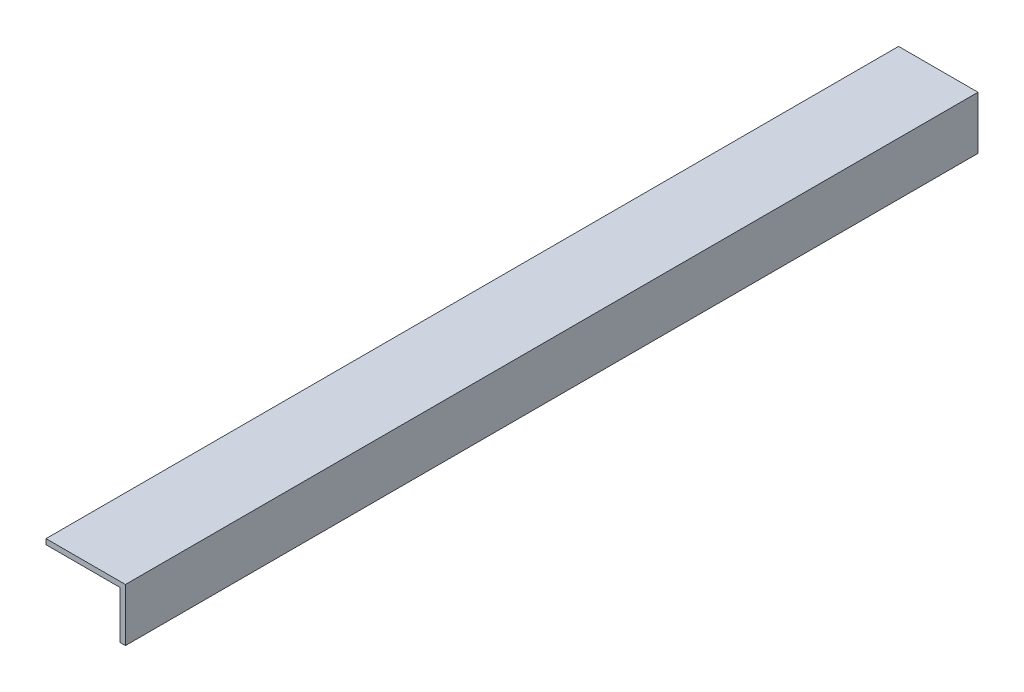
from build123d import *

# Parameters (mm, degrees)
SKETCH1_W           = 15
SKETCH1_H           = 10
BOSS_EXTRUDE1_DEPTH = 161
SKETCH2_W           = 14
SKETCH2_H           = 9
CUT_EXTRUDE1_DEPTH  = 161


with BuildPart() as part:
    # Sketch1 → Boss-Extrude1 (new body)
    with BuildSketch(Plane.XY):
        with Locations((7.5, 5)):
            Rectangle(SKETCH1_W, SKETCH1_H)
    extrude(amount=BOSS_EXTRUDE1_DEPTH)

    # Sketch2 → Cut-Extrude1 (cut)
    with BuildSketch(Plane(origin=(0, 0, 0), x_dir=(-1, 0, 0), z_dir=(0, 0, -1))):
        with Locations((-7, 4.5)):
            Rectangle(SKETCH2_W, SKETCH2_H)
    extrude(amount=-CUT_EXTRUDE1_DEPTH, mode=Mode.SUBTRACT)


solid = part.part
